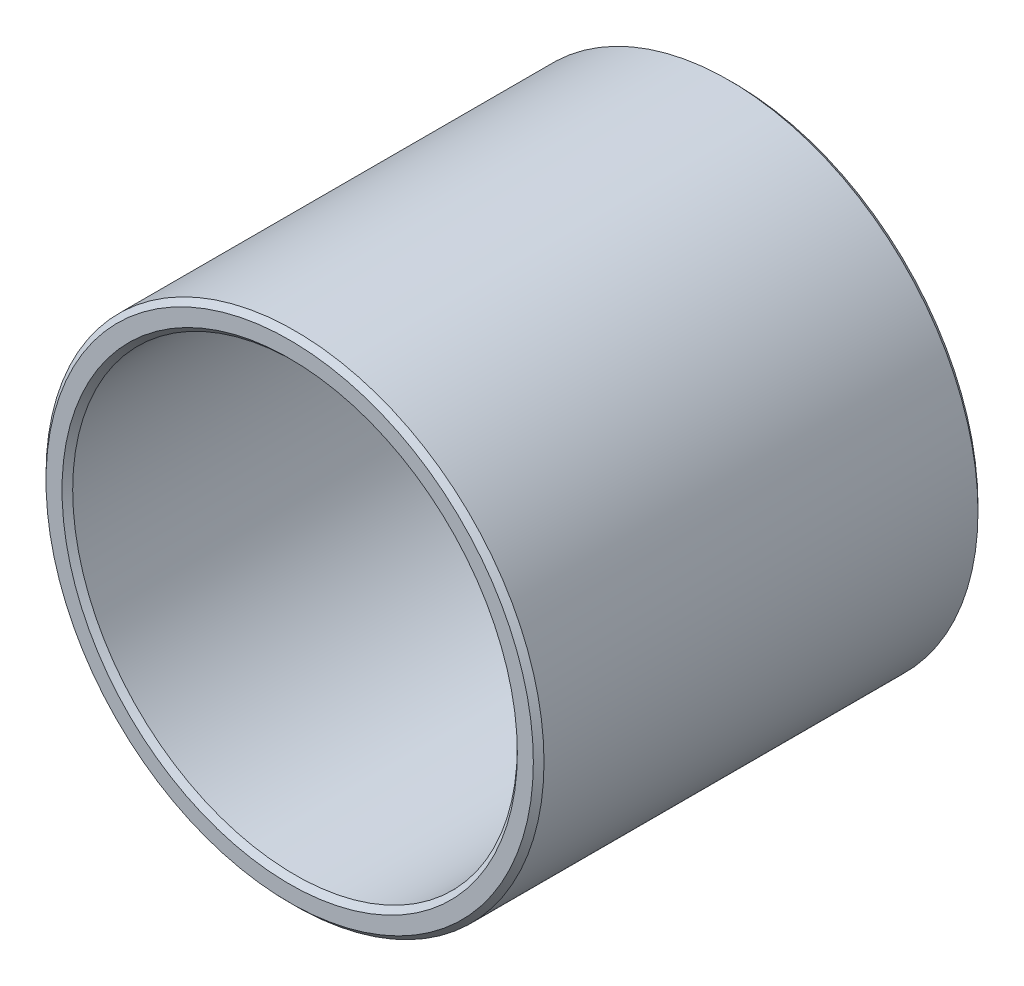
ISO-10303-21;
HEADER;
FILE_DESCRIPTION(('STEP AP214'),'2;1');
FILE_NAME('part.step','',(''),(''),'','','');
FILE_SCHEMA(('AUTOMOTIVE_DESIGN { 1 0 10303 214 1 1 1 1 }'));
ENDSEC;
DATA;
#1=APPLICATION_CONTEXT('core data for automotive mechanical design processes');
#2=APPLICATION_PROTOCOL_DEFINITION('international standard','automotive_design',2000,#1);
#3=PRODUCT_CONTEXT('',#1,'mechanical');
#4=PRODUCT('Part','Part','',(#3));
#5=PRODUCT_RELATED_PRODUCT_CATEGORY('part','',(#4));
#6=PRODUCT_DEFINITION_FORMATION('','',#4);
#7=PRODUCT_DEFINITION_CONTEXT('part definition',#1,'design');
#8=PRODUCT_DEFINITION('design','',#6,#7);
#9=PRODUCT_DEFINITION_SHAPE('','',#8);
#10=(LENGTH_UNIT() NAMED_UNIT(*) SI_UNIT(.MILLI.,.METRE.));
#11=(NAMED_UNIT(*) PLANE_ANGLE_UNIT() SI_UNIT($,.RADIAN.));
#12=(NAMED_UNIT(*) SI_UNIT($,.STERADIAN.) SOLID_ANGLE_UNIT());
#13=UNCERTAINTY_MEASURE_WITH_UNIT(LENGTH_MEASURE(1.E-05),#10,'distance_accuracy_value','');
#14=(GEOMETRIC_REPRESENTATION_CONTEXT(3) GLOBAL_UNCERTAINTY_ASSIGNED_CONTEXT((#13)) GLOBAL_UNIT_ASSIGNED_CONTEXT((#10,
#11,#12)) REPRESENTATION_CONTEXT('',''));
#15=CARTESIAN_POINT('',(0.,0.,0.));
#16=DIRECTION('',(0.,0.,1.));
#17=DIRECTION('',(1.,0.,0.));
#18=AXIS2_PLACEMENT_3D('',#15,#16,#17);
#19=CARTESIAN_POINT('',(0.,0.,-25.));
#20=DIRECTION('',(0.,0.,1.));
#21=DIRECTION('',(1.,0.,0.));
#22=AXIS2_PLACEMENT_3D('',#19,#20,#21);
#23=CYLINDRICAL_SURFACE('',#22,14.);
#24=CARTESIAN_POINT('',(0.,0.,-0.300000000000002));
#25=DIRECTION('',(0.,0.,1.));
#26=DIRECTION('',(1.,0.,0.));
#27=AXIS2_PLACEMENT_3D('',#24,#25,#26);
#28=CIRCLE('',#27,14.);
#29=CARTESIAN_POINT('',(14.,0.,-0.300000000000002));
#30=VERTEX_POINT('',#29);
#31=EDGE_CURVE('E41',#30,#30,#28,.F.);
#32=ORIENTED_EDGE('',*,*,#31,.T.);
#33=EDGE_LOOP('',(#32));
#34=FACE_BOUND('',#33,.T.);
#35=CARTESIAN_POINT('',(0.,0.,-24.7));
#36=DIRECTION('',(0.,0.,1.));
#37=DIRECTION('',(1.,0.,0.));
#38=AXIS2_PLACEMENT_3D('',#35,#36,#37);
#39=CIRCLE('',#38,14.);
#40=CARTESIAN_POINT('',(14.,0.,-24.7));
#41=VERTEX_POINT('',#40);
#42=EDGE_CURVE('E44',#41,#41,#39,.T.);
#43=ORIENTED_EDGE('',*,*,#42,.T.);
#44=EDGE_LOOP('',(#43));
#45=FACE_BOUND('',#44,.T.);
#46=ADVANCED_FACE('F22',(#34,#45),#23,.T.);
#47=CARTESIAN_POINT('',(0.,0.,-25.));
#48=DIRECTION('',(0.,0.,1.));
#49=DIRECTION('',(1.,0.,0.));
#50=AXIS2_PLACEMENT_3D('',#47,#48,#49);
#51=PLANE('',#50);
#52=CARTESIAN_POINT('',(0.,0.,-25.));
#53=DIRECTION('',(0.,0.,1.));
#54=DIRECTION('',(1.,0.,0.));
#55=AXIS2_PLACEMENT_3D('',#52,#53,#54);
#56=CIRCLE('',#55,13.7);
#57=CARTESIAN_POINT('',(13.7,0.,-25.));
#58=VERTEX_POINT('',#57);
#59=EDGE_CURVE('E32',#58,#58,#56,.F.);
#60=ORIENTED_EDGE('',*,*,#59,.T.);
#61=EDGE_LOOP('',(#60));
#62=FACE_BOUND('',#61,.T.);
#63=CARTESIAN_POINT('',(0.,0.,-25.));
#64=DIRECTION('',(0.,0.,1.));
#65=DIRECTION('',(1.,0.,0.));
#66=AXIS2_PLACEMENT_3D('',#63,#64,#65);
#67=CIRCLE('',#66,12.8);
#68=CARTESIAN_POINT('',(12.8,0.,-25.));
#69=VERTEX_POINT('',#68);
#70=EDGE_CURVE('E36',#69,#69,#67,.T.);
#71=ORIENTED_EDGE('',*,*,#70,.T.);
#72=EDGE_LOOP('',(#71));
#73=FACE_BOUND('',#72,.T.);
#74=ADVANCED_FACE('F72',(#62,#73),#51,.F.);
#75=CARTESIAN_POINT('',(0.,0.,0.));
#76=DIRECTION('',(0.,0.,1.));
#77=DIRECTION('',(1.,0.,0.));
#78=AXIS2_PLACEMENT_3D('',#75,#76,#77);
#79=PLANE('',#78);
#80=CARTESIAN_POINT('',(0.,0.,0.));
#81=DIRECTION('',(0.,0.,1.));
#82=DIRECTION('',(1.,0.,0.));
#83=AXIS2_PLACEMENT_3D('',#80,#81,#82);
#84=CIRCLE('',#83,13.7);
#85=CARTESIAN_POINT('',(13.7,0.,0.));
#86=VERTEX_POINT('',#85);
#87=EDGE_CURVE('E47',#86,#86,#84,.T.);
#88=ORIENTED_EDGE('',*,*,#87,.T.);
#89=EDGE_LOOP('',(#88));
#90=FACE_BOUND('',#89,.T.);
#91=CARTESIAN_POINT('',(0.,0.,0.));
#92=DIRECTION('',(0.,0.,1.));
#93=DIRECTION('',(1.,0.,0.));
#94=AXIS2_PLACEMENT_3D('',#91,#92,#93);
#95=CIRCLE('',#94,12.8);
#96=CARTESIAN_POINT('',(12.8,0.,0.));
#97=VERTEX_POINT('',#96);
#98=EDGE_CURVE('E50',#97,#97,#95,.F.);
#99=ORIENTED_EDGE('',*,*,#98,.T.);
#100=EDGE_LOOP('',(#99));
#101=FACE_BOUND('',#100,.T.);
#102=ADVANCED_FACE('F54',(#90,#101),#79,.T.);
#103=CARTESIAN_POINT('',(0.,0.,-25.));
#104=DIRECTION('',(0.,0.,1.));
#105=DIRECTION('',(1.,0.,0.));
#106=AXIS2_PLACEMENT_3D('',#103,#104,#105);
#107=CYLINDRICAL_SURFACE('',#106,12.5);
#108=CARTESIAN_POINT('',(0.,0.,-0.3));
#109=DIRECTION('',(0.,0.,1.));
#110=DIRECTION('',(1.,0.,0.));
#111=AXIS2_PLACEMENT_3D('',#108,#109,#110);
#112=CIRCLE('',#111,12.5);
#113=CARTESIAN_POINT('',(12.5,0.,-0.3));
#114=VERTEX_POINT('',#113);
#115=EDGE_CURVE('E10',#114,#114,#112,.T.);
#116=ORIENTED_EDGE('',*,*,#115,.T.);
#117=EDGE_LOOP('',(#116));
#118=FACE_BOUND('',#117,.T.);
#119=CARTESIAN_POINT('',(0.,0.,-24.7));
#120=DIRECTION('',(0.,0.,1.));
#121=DIRECTION('',(1.,0.,0.));
#122=AXIS2_PLACEMENT_3D('',#119,#120,#121);
#123=CIRCLE('',#122,12.5);
#124=CARTESIAN_POINT('',(12.5,0.,-24.7));
#125=VERTEX_POINT('',#124);
#126=EDGE_CURVE('E28',#125,#125,#123,.F.);
#127=ORIENTED_EDGE('',*,*,#126,.T.);
#128=EDGE_LOOP('',(#127));
#129=FACE_BOUND('',#128,.T.);
#130=ADVANCED_FACE('F85',(#118,#129),#107,.F.);
#131=CARTESIAN_POINT('',(0.,0.,0.));
#132=DIRECTION('',(0.,0.,-1.));
#133=DIRECTION('',(-1.,0.,0.));
#134=AXIS2_PLACEMENT_3D('',#131,#132,#133);
#135=CONICAL_SURFACE('',#134,13.7,0.785398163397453);
#136=ORIENTED_EDGE('',*,*,#31,.F.);
#137=EDGE_LOOP('',(#136));
#138=FACE_BOUND('',#137,.T.);
#139=ORIENTED_EDGE('',*,*,#87,.F.);
#140=EDGE_LOOP('',(#139));
#141=FACE_BOUND('',#140,.T.);
#142=ADVANCED_FACE('F68',(#138,#141),#135,.T.);
#143=CARTESIAN_POINT('',(0.,0.,-24.7));
#144=DIRECTION('',(0.,0.,1.));
#145=DIRECTION('',(1.,0.,0.));
#146=AXIS2_PLACEMENT_3D('',#143,#144,#145);
#147=CONICAL_SURFACE('',#146,14.,0.785398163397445);
#148=ORIENTED_EDGE('',*,*,#59,.F.);
#149=EDGE_LOOP('',(#148));
#150=FACE_BOUND('',#149,.T.);
#151=ORIENTED_EDGE('',*,*,#42,.F.);
#152=EDGE_LOOP('',(#151));
#153=FACE_BOUND('',#152,.T.);
#154=ADVANCED_FACE('F60',(#150,#153),#147,.T.);
#155=CARTESIAN_POINT('',(0.,0.,-0.3));
#156=DIRECTION('',(0.,0.,1.));
#157=DIRECTION('',(1.,0.,0.));
#158=AXIS2_PLACEMENT_3D('',#155,#156,#157);
#159=CONICAL_SURFACE('',#158,12.5,0.785398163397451);
#160=ORIENTED_EDGE('',*,*,#98,.F.);
#161=EDGE_LOOP('',(#160));
#162=FACE_BOUND('',#161,.T.);
#163=ORIENTED_EDGE('',*,*,#115,.F.);
#164=EDGE_LOOP('',(#163));
#165=FACE_BOUND('',#164,.T.);
#166=ADVANCED_FACE('F56',(#162,#165),#159,.F.);
#167=CARTESIAN_POINT('',(0.,0.,-25.));
#168=DIRECTION('',(0.,0.,-1.));
#169=DIRECTION('',(-1.,0.,0.));
#170=AXIS2_PLACEMENT_3D('',#167,#168,#169);
#171=CONICAL_SURFACE('',#170,12.8,0.785398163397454);
#172=ORIENTED_EDGE('',*,*,#126,.F.);
#173=EDGE_LOOP('',(#172));
#174=FACE_BOUND('',#173,.T.);
#175=ORIENTED_EDGE('',*,*,#70,.F.);
#176=EDGE_LOOP('',(#175));
#177=FACE_BOUND('',#176,.T.);
#178=ADVANCED_FACE('F59',(#174,#177),#171,.F.);
#179=CLOSED_SHELL('',(#46,#74,#102,#130,#142,#154,#166,#178));
#180=MANIFOLD_SOLID_BREP('B2',#179);
#181=ADVANCED_BREP_SHAPE_REPRESENTATION('',(#18,#180),#14);
#182=SHAPE_DEFINITION_REPRESENTATION(#9,#181);
ENDSEC;
END-ISO-10303-21;
